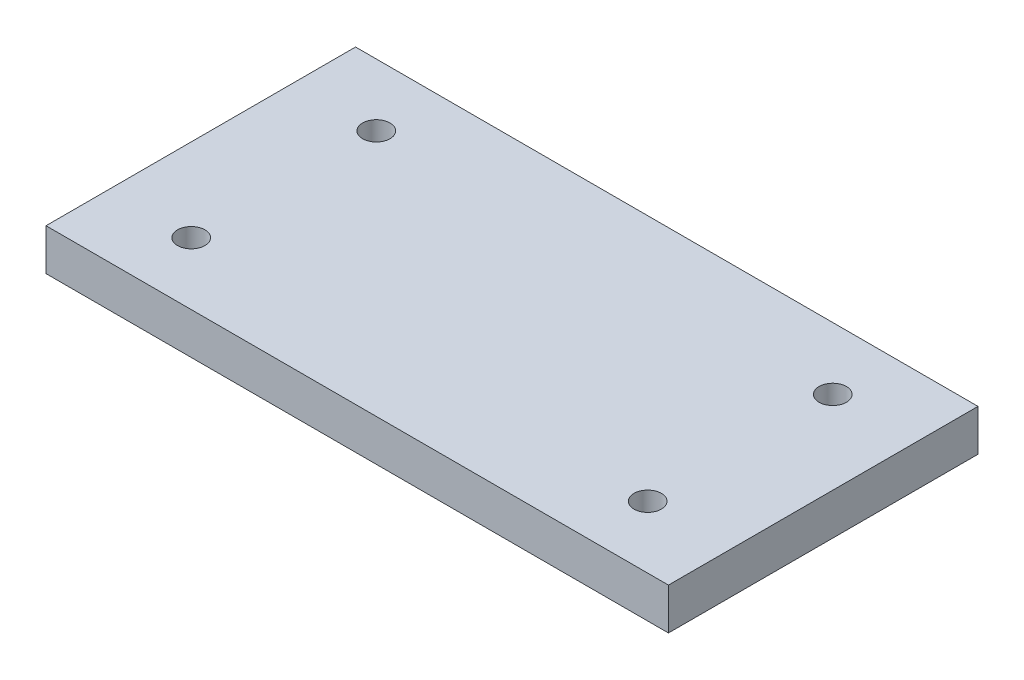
ISO-10303-21;
HEADER;
FILE_DESCRIPTION(('STEP AP214'),'2;1');
FILE_NAME('part.step','',(''),(''),'','','');
FILE_SCHEMA(('AUTOMOTIVE_DESIGN { 1 0 10303 214 1 1 1 1 }'));
ENDSEC;
DATA;
#1=APPLICATION_CONTEXT('core data for automotive mechanical design processes');
#2=APPLICATION_PROTOCOL_DEFINITION('international standard','automotive_design',2000,#1);
#3=PRODUCT_CONTEXT('',#1,'mechanical');
#4=PRODUCT('Part','Part','',(#3));
#5=PRODUCT_RELATED_PRODUCT_CATEGORY('part','',(#4));
#6=PRODUCT_DEFINITION_FORMATION('','',#4);
#7=PRODUCT_DEFINITION_CONTEXT('part definition',#1,'design');
#8=PRODUCT_DEFINITION('design','',#6,#7);
#9=PRODUCT_DEFINITION_SHAPE('','',#8);
#10=(LENGTH_UNIT() NAMED_UNIT(*) SI_UNIT(.MILLI.,.METRE.));
#11=(NAMED_UNIT(*) PLANE_ANGLE_UNIT() SI_UNIT($,.RADIAN.));
#12=(NAMED_UNIT(*) SI_UNIT($,.STERADIAN.) SOLID_ANGLE_UNIT());
#13=UNCERTAINTY_MEASURE_WITH_UNIT(LENGTH_MEASURE(1.E-05),#10,'distance_accuracy_value','');
#14=(GEOMETRIC_REPRESENTATION_CONTEXT(3) GLOBAL_UNCERTAINTY_ASSIGNED_CONTEXT((#13)) GLOBAL_UNIT_ASSIGNED_CONTEXT((#10,
#11,#12)) REPRESENTATION_CONTEXT('',''));
#15=CARTESIAN_POINT('',(0.,0.,0.));
#16=DIRECTION('',(0.,0.,1.));
#17=DIRECTION('',(1.,0.,0.));
#18=AXIS2_PLACEMENT_3D('',#15,#16,#17);
#19=CARTESIAN_POINT('',(0.,5.,0.));
#20=DIRECTION('',(0.,1.,0.));
#21=DIRECTION('',(0.,0.,1.));
#22=AXIS2_PLACEMENT_3D('',#19,#20,#21);
#23=PLANE('',#22);
#24=CARTESIAN_POINT('',(-10.,5.,7.5));
#25=DIRECTION('',(0.,1.,0.));
#26=DIRECTION('',(0.,0.,1.));
#27=AXIS2_PLACEMENT_3D('',#24,#25,#26);
#28=CIRCLE('',#27,1.65);
#29=CARTESIAN_POINT('',(-10.,5.,9.15));
#30=VERTEX_POINT('',#29);
#31=EDGE_CURVE('E125',#30,#30,#28,.T.);
#32=ORIENTED_EDGE('',*,*,#31,.F.);
#33=EDGE_LOOP('',(#32));
#34=FACE_BOUND('',#33,.T.);
#35=CARTESIAN_POINT('',(-65.,5.,7.5));
#36=DIRECTION('',(0.,1.,0.));
#37=DIRECTION('',(0.,0.,1.));
#38=AXIS2_PLACEMENT_3D('',#35,#36,#37);
#39=CIRCLE('',#38,1.65);
#40=CARTESIAN_POINT('',(-65.,5.,9.15));
#41=VERTEX_POINT('',#40);
#42=EDGE_CURVE('E104',#41,#41,#39,.T.);
#43=ORIENTED_EDGE('',*,*,#42,.F.);
#44=EDGE_LOOP('',(#43));
#45=FACE_BOUND('',#44,.T.);
#46=DIRECTION('',(0.,0.,1.));
#47=VECTOR('',#46,1.);
#48=CARTESIAN_POINT('',(-75.,5.,0.));
#49=LINE('',#48,#47);
#50=CARTESIAN_POINT('',(-75.,5.,0.));
#51=VERTEX_POINT('',#50);
#52=CARTESIAN_POINT('',(-75.,5.,37.3));
#53=VERTEX_POINT('',#52);
#54=EDGE_CURVE('E89',#51,#53,#49,.T.);
#55=ORIENTED_EDGE('',*,*,#54,.T.);
#56=DIRECTION('',(1.,0.,0.));
#57=VECTOR('',#56,1.);
#58=CARTESIAN_POINT('',(-75.,5.,37.3));
#59=LINE('',#58,#57);
#60=CARTESIAN_POINT('',(0.,5.,37.3));
#61=VERTEX_POINT('',#60);
#62=EDGE_CURVE('E84',#53,#61,#59,.T.);
#63=ORIENTED_EDGE('',*,*,#62,.T.);
#64=DIRECTION('',(0.,0.,-1.));
#65=VECTOR('',#64,1.);
#66=CARTESIAN_POINT('',(0.,5.,0.));
#67=LINE('',#66,#65);
#68=CARTESIAN_POINT('',(0.,5.,0.));
#69=VERTEX_POINT('',#68);
#70=EDGE_CURVE('E87',#61,#69,#67,.T.);
#71=ORIENTED_EDGE('',*,*,#70,.T.);
#72=DIRECTION('',(-1.,0.,0.));
#73=VECTOR('',#72,1.);
#74=CARTESIAN_POINT('',(-75.,5.,0.));
#75=LINE('',#74,#73);
#76=EDGE_CURVE('E54',#69,#51,#75,.T.);
#77=ORIENTED_EDGE('',*,*,#76,.T.);
#78=EDGE_LOOP('',(#55,#63,#71,#77));
#79=FACE_BOUND('',#78,.T.);
#80=CARTESIAN_POINT('',(-65.,5.,29.8));
#81=DIRECTION('',(0.,1.,0.));
#82=DIRECTION('',(0.,0.,1.));
#83=AXIS2_PLACEMENT_3D('',#80,#81,#82);
#84=CIRCLE('',#83,1.65);
#85=CARTESIAN_POINT('',(-65.,5.,31.45));
#86=VERTEX_POINT('',#85);
#87=EDGE_CURVE('E119',#86,#86,#84,.T.);
#88=ORIENTED_EDGE('',*,*,#87,.F.);
#89=EDGE_LOOP('',(#88));
#90=FACE_BOUND('',#89,.T.);
#91=CARTESIAN_POINT('',(-9.99999999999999,5.,29.8));
#92=DIRECTION('',(0.,1.,0.));
#93=DIRECTION('',(0.,0.,1.));
#94=AXIS2_PLACEMENT_3D('',#91,#92,#93);
#95=CIRCLE('',#94,1.65);
#96=CARTESIAN_POINT('',(-9.99999999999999,5.,31.45));
#97=VERTEX_POINT('',#96);
#98=EDGE_CURVE('E131',#97,#97,#95,.T.);
#99=ORIENTED_EDGE('',*,*,#98,.F.);
#100=EDGE_LOOP('',(#99));
#101=FACE_BOUND('',#100,.T.);
#102=ADVANCED_FACE('F37',(#34,#45,#79,#90,#101),#23,.T.);
#103=CARTESIAN_POINT('',(0.,0.,0.));
#104=DIRECTION('',(0.,1.,0.));
#105=DIRECTION('',(0.,0.,1.));
#106=AXIS2_PLACEMENT_3D('',#103,#104,#105);
#107=PLANE('',#106);
#108=DIRECTION('',(0.,0.,1.));
#109=VECTOR('',#108,1.);
#110=CARTESIAN_POINT('',(-75.,0.,0.));
#111=LINE('',#110,#109);
#112=CARTESIAN_POINT('',(-75.,0.,0.));
#113=VERTEX_POINT('',#112);
#114=CARTESIAN_POINT('',(-75.,0.,37.3));
#115=VERTEX_POINT('',#114);
#116=EDGE_CURVE('E101',#113,#115,#111,.T.);
#117=ORIENTED_EDGE('',*,*,#116,.F.);
#118=DIRECTION('',(-1.,0.,0.));
#119=VECTOR('',#118,1.);
#120=CARTESIAN_POINT('',(-75.,0.,0.));
#121=LINE('',#120,#119);
#122=CARTESIAN_POINT('',(0.,0.,0.));
#123=VERTEX_POINT('',#122);
#124=EDGE_CURVE('E77',#123,#113,#121,.T.);
#125=ORIENTED_EDGE('',*,*,#124,.F.);
#126=DIRECTION('',(0.,0.,-1.));
#127=VECTOR('',#126,1.);
#128=CARTESIAN_POINT('',(0.,0.,0.));
#129=LINE('',#128,#127);
#130=CARTESIAN_POINT('',(0.,0.,37.3));
#131=VERTEX_POINT('',#130);
#132=EDGE_CURVE('E71',#131,#123,#129,.T.);
#133=ORIENTED_EDGE('',*,*,#132,.F.);
#134=DIRECTION('',(1.,0.,0.));
#135=VECTOR('',#134,1.);
#136=CARTESIAN_POINT('',(-75.,0.,37.3));
#137=LINE('',#136,#135);
#138=EDGE_CURVE('E93',#115,#131,#137,.T.);
#139=ORIENTED_EDGE('',*,*,#138,.F.);
#140=EDGE_LOOP('',(#117,#125,#133,#139));
#141=FACE_BOUND('',#140,.T.);
#142=CARTESIAN_POINT('',(-65.,0.,7.5));
#143=DIRECTION('',(0.,1.,0.));
#144=DIRECTION('',(0.,0.,1.));
#145=AXIS2_PLACEMENT_3D('',#142,#143,#144);
#146=CIRCLE('',#145,1.65);
#147=CARTESIAN_POINT('',(-65.,0.,9.15));
#148=VERTEX_POINT('',#147);
#149=EDGE_CURVE('E116',#148,#148,#146,.T.);
#150=ORIENTED_EDGE('',*,*,#149,.T.);
#151=EDGE_LOOP('',(#150));
#152=FACE_BOUND('',#151,.T.);
#153=CARTESIAN_POINT('',(-65.,0.,29.8));
#154=DIRECTION('',(0.,1.,0.));
#155=DIRECTION('',(0.,0.,1.));
#156=AXIS2_PLACEMENT_3D('',#153,#154,#155);
#157=CIRCLE('',#156,1.65);
#158=CARTESIAN_POINT('',(-65.,0.,31.45));
#159=VERTEX_POINT('',#158);
#160=EDGE_CURVE('E122',#159,#159,#157,.T.);
#161=ORIENTED_EDGE('',*,*,#160,.T.);
#162=EDGE_LOOP('',(#161));
#163=FACE_BOUND('',#162,.T.);
#164=CARTESIAN_POINT('',(-10.,0.,7.5));
#165=DIRECTION('',(0.,1.,0.));
#166=DIRECTION('',(0.,0.,1.));
#167=AXIS2_PLACEMENT_3D('',#164,#165,#166);
#168=CIRCLE('',#167,1.65);
#169=CARTESIAN_POINT('',(-10.,0.,9.15));
#170=VERTEX_POINT('',#169);
#171=EDGE_CURVE('E128',#170,#170,#168,.T.);
#172=ORIENTED_EDGE('',*,*,#171,.T.);
#173=EDGE_LOOP('',(#172));
#174=FACE_BOUND('',#173,.T.);
#175=CARTESIAN_POINT('',(-9.99999999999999,0.,29.8));
#176=DIRECTION('',(0.,1.,0.));
#177=DIRECTION('',(0.,0.,1.));
#178=AXIS2_PLACEMENT_3D('',#175,#176,#177);
#179=CIRCLE('',#178,1.65);
#180=CARTESIAN_POINT('',(-9.99999999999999,0.,31.45));
#181=VERTEX_POINT('',#180);
#182=EDGE_CURVE('E134',#181,#181,#179,.T.);
#183=ORIENTED_EDGE('',*,*,#182,.T.);
#184=EDGE_LOOP('',(#183));
#185=FACE_BOUND('',#184,.T.);
#186=ADVANCED_FACE('F112',(#141,#152,#163,#174,#185),#107,.F.);
#187=CARTESIAN_POINT('',(-75.,5.,0.));
#188=DIRECTION('',(1.,0.,0.));
#189=DIRECTION('',(0.,0.,-1.));
#190=AXIS2_PLACEMENT_3D('',#187,#188,#189);
#191=PLANE('',#190);
#192=ORIENTED_EDGE('',*,*,#116,.T.);
#193=DIRECTION('',(0.,-1.,0.));
#194=VECTOR('',#193,1.);
#195=CARTESIAN_POINT('',(-75.,5.,37.3));
#196=LINE('',#195,#194);
#197=EDGE_CURVE('E11',#53,#115,#196,.T.);
#198=ORIENTED_EDGE('',*,*,#197,.F.);
#199=ORIENTED_EDGE('',*,*,#54,.F.);
#200=DIRECTION('',(0.,-1.,0.));
#201=VECTOR('',#200,1.);
#202=CARTESIAN_POINT('',(-75.,5.,0.));
#203=LINE('',#202,#201);
#204=EDGE_CURVE('E97',#51,#113,#203,.T.);
#205=ORIENTED_EDGE('',*,*,#204,.T.);
#206=EDGE_LOOP('',(#192,#198,#199,#205));
#207=FACE_BOUND('',#206,.T.);
#208=ADVANCED_FACE('F39',(#207),#191,.F.);
#209=CARTESIAN_POINT('',(-75.,5.,37.3));
#210=DIRECTION('',(0.,0.,-1.));
#211=DIRECTION('',(-1.,0.,0.));
#212=AXIS2_PLACEMENT_3D('',#209,#210,#211);
#213=PLANE('',#212);
#214=ORIENTED_EDGE('',*,*,#138,.T.);
#215=DIRECTION('',(0.,-1.,0.));
#216=VECTOR('',#215,1.);
#217=CARTESIAN_POINT('',(0.,5.,37.3));
#218=LINE('',#217,#216);
#219=EDGE_CURVE('E46',#61,#131,#218,.T.);
#220=ORIENTED_EDGE('',*,*,#219,.F.);
#221=ORIENTED_EDGE('',*,*,#62,.F.);
#222=ORIENTED_EDGE('',*,*,#197,.T.);
#223=EDGE_LOOP('',(#214,#220,#221,#222));
#224=FACE_BOUND('',#223,.T.);
#225=ADVANCED_FACE('F92',(#224),#213,.F.);
#226=CARTESIAN_POINT('',(0.,5.,0.));
#227=DIRECTION('',(-1.,0.,0.));
#228=DIRECTION('',(0.,0.,1.));
#229=AXIS2_PLACEMENT_3D('',#226,#227,#228);
#230=PLANE('',#229);
#231=ORIENTED_EDGE('',*,*,#132,.T.);
#232=DIRECTION('',(0.,-1.,0.));
#233=VECTOR('',#232,1.);
#234=CARTESIAN_POINT('',(0.,5.,0.));
#235=LINE('',#234,#233);
#236=EDGE_CURVE('E94',#69,#123,#235,.T.);
#237=ORIENTED_EDGE('',*,*,#236,.F.);
#238=ORIENTED_EDGE('',*,*,#70,.F.);
#239=ORIENTED_EDGE('',*,*,#219,.T.);
#240=EDGE_LOOP('',(#231,#237,#238,#239));
#241=FACE_BOUND('',#240,.T.);
#242=ADVANCED_FACE('F95',(#241),#230,.F.);
#243=CARTESIAN_POINT('',(-75.,5.,0.));
#244=DIRECTION('',(0.,0.,1.));
#245=DIRECTION('',(1.,0.,0.));
#246=AXIS2_PLACEMENT_3D('',#243,#244,#245);
#247=PLANE('',#246);
#248=ORIENTED_EDGE('',*,*,#124,.T.);
#249=ORIENTED_EDGE('',*,*,#204,.F.);
#250=ORIENTED_EDGE('',*,*,#76,.F.);
#251=ORIENTED_EDGE('',*,*,#236,.T.);
#252=EDGE_LOOP('',(#248,#249,#250,#251));
#253=FACE_BOUND('',#252,.T.);
#254=ADVANCED_FACE('F109',(#253),#247,.F.);
#255=CARTESIAN_POINT('',(-65.,5.,7.5));
#256=DIRECTION('',(0.,-1.,0.));
#257=DIRECTION('',(0.,0.,-1.));
#258=AXIS2_PLACEMENT_3D('',#255,#256,#257);
#259=CYLINDRICAL_SURFACE('',#258,1.65);
#260=ORIENTED_EDGE('',*,*,#42,.T.);
#261=EDGE_LOOP('',(#260));
#262=FACE_BOUND('',#261,.T.);
#263=ORIENTED_EDGE('',*,*,#149,.F.);
#264=EDGE_LOOP('',(#263));
#265=FACE_BOUND('',#264,.T.);
#266=ADVANCED_FACE('F153',(#262,#265),#259,.F.);
#267=CARTESIAN_POINT('',(-65.,5.,29.8));
#268=DIRECTION('',(0.,-1.,0.));
#269=DIRECTION('',(0.,0.,-1.));
#270=AXIS2_PLACEMENT_3D('',#267,#268,#269);
#271=CYLINDRICAL_SURFACE('',#270,1.65);
#272=ORIENTED_EDGE('',*,*,#87,.T.);
#273=EDGE_LOOP('',(#272));
#274=FACE_BOUND('',#273,.T.);
#275=ORIENTED_EDGE('',*,*,#160,.F.);
#276=EDGE_LOOP('',(#275));
#277=FACE_BOUND('',#276,.T.);
#278=ADVANCED_FACE('F207',(#274,#277),#271,.F.);
#279=CARTESIAN_POINT('',(-10.,5.,7.5));
#280=DIRECTION('',(0.,-1.,0.));
#281=DIRECTION('',(0.,0.,-1.));
#282=AXIS2_PLACEMENT_3D('',#279,#280,#281);
#283=CYLINDRICAL_SURFACE('',#282,1.65);
#284=ORIENTED_EDGE('',*,*,#31,.T.);
#285=EDGE_LOOP('',(#284));
#286=FACE_BOUND('',#285,.T.);
#287=ORIENTED_EDGE('',*,*,#171,.F.);
#288=EDGE_LOOP('',(#287));
#289=FACE_BOUND('',#288,.T.);
#290=ADVANCED_FACE('F216',(#286,#289),#283,.F.);
#291=CARTESIAN_POINT('',(-9.99999999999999,5.,29.8));
#292=DIRECTION('',(0.,-1.,0.));
#293=DIRECTION('',(0.,0.,-1.));
#294=AXIS2_PLACEMENT_3D('',#291,#292,#293);
#295=CYLINDRICAL_SURFACE('',#294,1.65);
#296=ORIENTED_EDGE('',*,*,#98,.T.);
#297=EDGE_LOOP('',(#296));
#298=FACE_BOUND('',#297,.T.);
#299=ORIENTED_EDGE('',*,*,#182,.F.);
#300=EDGE_LOOP('',(#299));
#301=FACE_BOUND('',#300,.T.);
#302=ADVANCED_FACE('F140',(#298,#301),#295,.F.);
#303=CLOSED_SHELL('',(#102,#186,#208,#225,#242,#254,#266,#278,#290,#302));
#304=MANIFOLD_SOLID_BREP('B2',#303);
#305=ADVANCED_BREP_SHAPE_REPRESENTATION('',(#18,#304),#14);
#306=SHAPE_DEFINITION_REPRESENTATION(#9,#305);
ENDSEC;
END-ISO-10303-21;
